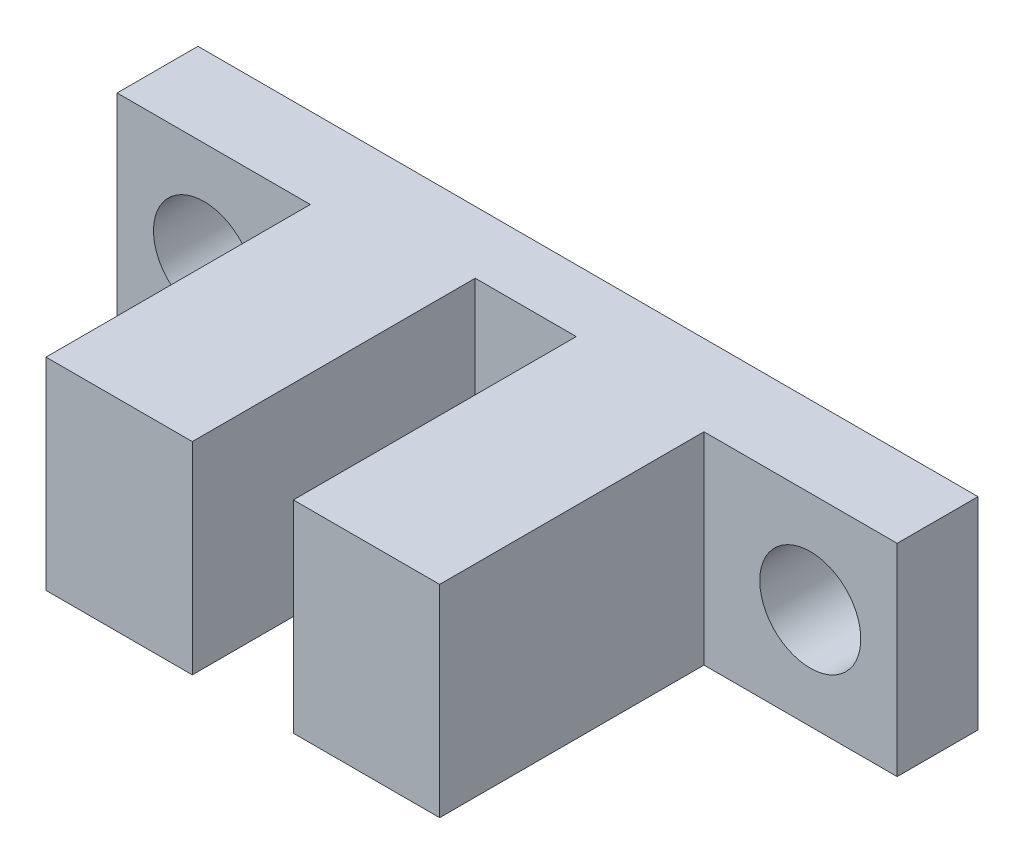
from build123d import *

# Parameters (mm, degrees)
SKETCH1_W           = 24.511
SKETCH1_H           = 6.35
BOSS_EXTRUDE1_DEPTH = 2.54
SKETCH2_W           = 12.3698
SKETCH2_H           = 6.35
BOSS_EXTRUDE2_DEPTH = 8.3058
SKETCH3_W           = 3.175
SKETCH3_H           = 6.35
CUT_EXTRUDE1_DEPTH  = 8.89
SKETCH4_R           = 1.5875
CUT_EXTRUDE2_DEPTH  = 17.670611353


with BuildPart() as part:
    # Sketch1 → Boss-Extrude1 (new body)
    with BuildSketch(Plane.XY):
        Rectangle(SKETCH1_W, SKETCH1_H)
    extrude(amount=BOSS_EXTRUDE1_DEPTH)

    # Sketch2 → Boss-Extrude2 (add)
    with BuildSketch(Plane.XY.offset(2.54)):
        Rectangle(SKETCH2_W, SKETCH2_H)
    extrude(amount=BOSS_EXTRUDE2_DEPTH)

    # Sketch3 → Cut-Extrude1 (cut)
    with BuildSketch(Plane.XY.offset(10.8458)):
        Rectangle(SKETCH3_W, SKETCH3_H)
    extrude(amount=-CUT_EXTRUDE1_DEPTH, mode=Mode.SUBTRACT)

    # Sketch4 → Cut-Extrude2 (cut, through all)
    with BuildSketch(Plane(origin=(0, 0, 0), x_dir=(-1, 0, 0), z_dir=(0, 0, -1))):
        with Locations((9.525, 0)):
            Circle(SKETCH4_R)
        with Locations((-9.525, 0)):
            Circle(SKETCH4_R)
    extrude(amount=-CUT_EXTRUDE2_DEPTH, mode=Mode.SUBTRACT)


solid = part.part
